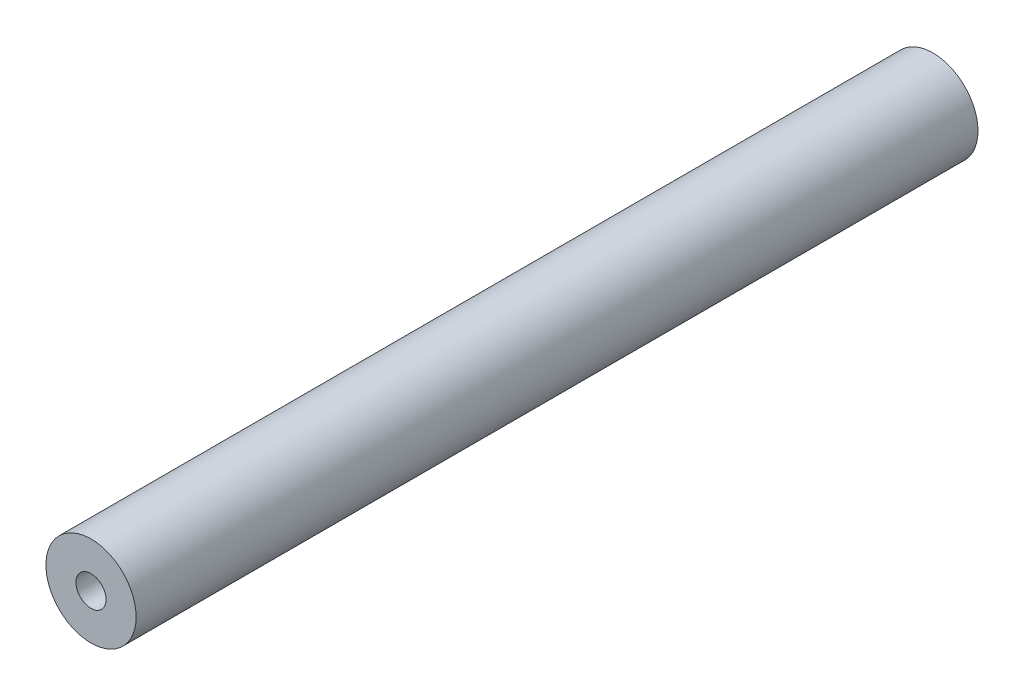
ISO-10303-21;
HEADER;
FILE_DESCRIPTION(('STEP AP214'),'2;1');
FILE_NAME('part.step','',(''),(''),'','','');
FILE_SCHEMA(('AUTOMOTIVE_DESIGN { 1 0 10303 214 1 1 1 1 }'));
ENDSEC;
DATA;
#1=APPLICATION_CONTEXT('core data for automotive mechanical design processes');
#2=APPLICATION_PROTOCOL_DEFINITION('international standard','automotive_design',2000,#1);
#3=PRODUCT_CONTEXT('',#1,'mechanical');
#4=PRODUCT('Part','Part','',(#3));
#5=PRODUCT_RELATED_PRODUCT_CATEGORY('part','',(#4));
#6=PRODUCT_DEFINITION_FORMATION('','',#4);
#7=PRODUCT_DEFINITION_CONTEXT('part definition',#1,'design');
#8=PRODUCT_DEFINITION('design','',#6,#7);
#9=PRODUCT_DEFINITION_SHAPE('','',#8);
#10=(LENGTH_UNIT() NAMED_UNIT(*) SI_UNIT(.MILLI.,.METRE.));
#11=(NAMED_UNIT(*) PLANE_ANGLE_UNIT() SI_UNIT($,.RADIAN.));
#12=(NAMED_UNIT(*) SI_UNIT($,.STERADIAN.) SOLID_ANGLE_UNIT());
#13=UNCERTAINTY_MEASURE_WITH_UNIT(LENGTH_MEASURE(1.E-05),#10,'distance_accuracy_value','');
#14=(GEOMETRIC_REPRESENTATION_CONTEXT(3) GLOBAL_UNCERTAINTY_ASSIGNED_CONTEXT((#13)) GLOBAL_UNIT_ASSIGNED_CONTEXT((#10,
#11,#12)) REPRESENTATION_CONTEXT('',''));
#15=CARTESIAN_POINT('',(0.,0.,0.));
#16=DIRECTION('',(0.,0.,1.));
#17=DIRECTION('',(1.,0.,0.));
#18=AXIS2_PLACEMENT_3D('',#15,#16,#17);
#19=CARTESIAN_POINT('',(0.,0.,140.));
#20=DIRECTION('',(0.,0.,-1.));
#21=DIRECTION('',(-1.,0.,0.));
#22=AXIS2_PLACEMENT_3D('',#19,#20,#21);
#23=CYLINDRICAL_SURFACE('',#22,7.5);
#24=CARTESIAN_POINT('',(0.,0.,140.));
#25=DIRECTION('',(0.,0.,1.));
#26=DIRECTION('',(1.,0.,0.));
#27=AXIS2_PLACEMENT_3D('',#24,#25,#26);
#28=CIRCLE('',#27,7.5);
#29=CARTESIAN_POINT('',(7.5,0.,140.));
#30=VERTEX_POINT('',#29);
#31=EDGE_CURVE('E10',#30,#30,#28,.T.);
#32=ORIENTED_EDGE('',*,*,#31,.F.);
#33=EDGE_LOOP('',(#32));
#34=FACE_BOUND('',#33,.T.);
#35=CARTESIAN_POINT('',(0.,0.,0.));
#36=DIRECTION('',(0.,0.,1.));
#37=DIRECTION('',(1.,0.,0.));
#38=AXIS2_PLACEMENT_3D('',#35,#36,#37);
#39=CIRCLE('',#38,7.5);
#40=CARTESIAN_POINT('',(7.5,0.,0.));
#41=VERTEX_POINT('',#40);
#42=EDGE_CURVE('E33',#41,#41,#39,.T.);
#43=ORIENTED_EDGE('',*,*,#42,.T.);
#44=EDGE_LOOP('',(#43));
#45=FACE_BOUND('',#44,.T.);
#46=ADVANCED_FACE('F30',(#34,#45),#23,.T.);
#47=CARTESIAN_POINT('',(0.,0.,140.));
#48=DIRECTION('',(0.,0.,1.));
#49=DIRECTION('',(1.,0.,0.));
#50=AXIS2_PLACEMENT_3D('',#47,#48,#49);
#51=PLANE('',#50);
#52=CARTESIAN_POINT('',(0.,0.,140.));
#53=DIRECTION('',(0.,0.,1.));
#54=DIRECTION('',(1.,0.,0.));
#55=AXIS2_PLACEMENT_3D('',#52,#53,#54);
#56=CIRCLE('',#55,2.5);
#57=CARTESIAN_POINT('',(2.5,0.,140.));
#58=VERTEX_POINT('',#57);
#59=EDGE_CURVE('E42',#58,#58,#56,.T.);
#60=ORIENTED_EDGE('',*,*,#59,.F.);
#61=EDGE_LOOP('',(#60));
#62=FACE_BOUND('',#61,.T.);
#63=ORIENTED_EDGE('',*,*,#31,.T.);
#64=EDGE_LOOP('',(#63));
#65=FACE_BOUND('',#64,.T.);
#66=ADVANCED_FACE('F67',(#62,#65),#51,.T.);
#67=CARTESIAN_POINT('',(0.,0.,0.));
#68=DIRECTION('',(0.,0.,1.));
#69=DIRECTION('',(1.,0.,0.));
#70=AXIS2_PLACEMENT_3D('',#67,#68,#69);
#71=PLANE('',#70);
#72=CARTESIAN_POINT('',(0.,0.,0.));
#73=DIRECTION('',(0.,0.,-1.));
#74=DIRECTION('',(-1.,0.,0.));
#75=AXIS2_PLACEMENT_3D('',#72,#73,#74);
#76=CIRCLE('',#75,2.5);
#77=CARTESIAN_POINT('',(-2.5,0.,0.));
#78=VERTEX_POINT('',#77);
#79=EDGE_CURVE('E48',#78,#78,#76,.T.);
#80=ORIENTED_EDGE('',*,*,#79,.F.);
#81=EDGE_LOOP('',(#80));
#82=FACE_BOUND('',#81,.T.);
#83=ORIENTED_EDGE('',*,*,#42,.F.);
#84=EDGE_LOOP('',(#83));
#85=FACE_BOUND('',#84,.T.);
#86=ADVANCED_FACE('F63',(#82,#85),#71,.F.);
#87=CARTESIAN_POINT('',(0.,0.,125.));
#88=DIRECTION('',(0.,0.,1.));
#89=DIRECTION('',(1.,0.,0.));
#90=AXIS2_PLACEMENT_3D('',#87,#88,#89);
#91=CYLINDRICAL_SURFACE('',#90,2.5);
#92=CARTESIAN_POINT('',(0.,0.,125.));
#93=DIRECTION('',(0.,0.,1.));
#94=DIRECTION('',(1.,0.,0.));
#95=AXIS2_PLACEMENT_3D('',#92,#93,#94);
#96=CIRCLE('',#95,2.5);
#97=CARTESIAN_POINT('',(2.5,0.,125.));
#98=VERTEX_POINT('',#97);
#99=EDGE_CURVE('E40',#98,#98,#96,.T.);
#100=ORIENTED_EDGE('',*,*,#99,.F.);
#101=EDGE_LOOP('',(#100));
#102=FACE_BOUND('',#101,.T.);
#103=ORIENTED_EDGE('',*,*,#59,.T.);
#104=EDGE_LOOP('',(#103));
#105=FACE_BOUND('',#104,.T.);
#106=ADVANCED_FACE('F66',(#102,#105),#91,.F.);
#107=CARTESIAN_POINT('',(0.,0.,125.));
#108=DIRECTION('',(0.,0.,1.));
#109=DIRECTION('',(1.,0.,0.));
#110=AXIS2_PLACEMENT_3D('',#107,#108,#109);
#111=PLANE('',#110);
#112=ORIENTED_EDGE('',*,*,#99,.T.);
#113=EDGE_LOOP('',(#112));
#114=FACE_BOUND('',#113,.T.);
#115=ADVANCED_FACE('F59',(#114),#111,.T.);
#116=CARTESIAN_POINT('',(0.,0.,15.));
#117=DIRECTION('',(0.,0.,-1.));
#118=DIRECTION('',(-1.,0.,0.));
#119=AXIS2_PLACEMENT_3D('',#116,#117,#118);
#120=CYLINDRICAL_SURFACE('',#119,2.5);
#121=CARTESIAN_POINT('',(0.,0.,15.));
#122=DIRECTION('',(0.,0.,-1.));
#123=DIRECTION('',(-1.,0.,0.));
#124=AXIS2_PLACEMENT_3D('',#121,#122,#123);
#125=CIRCLE('',#124,2.5);
#126=CARTESIAN_POINT('',(-2.5,0.,15.));
#127=VERTEX_POINT('',#126);
#128=EDGE_CURVE('E45',#127,#127,#125,.T.);
#129=ORIENTED_EDGE('',*,*,#128,.F.);
#130=EDGE_LOOP('',(#129));
#131=FACE_BOUND('',#130,.T.);
#132=ORIENTED_EDGE('',*,*,#79,.T.);
#133=EDGE_LOOP('',(#132));
#134=FACE_BOUND('',#133,.T.);
#135=ADVANCED_FACE('F56',(#131,#134),#120,.F.);
#136=CARTESIAN_POINT('',(0.,0.,15.));
#137=DIRECTION('',(0.,0.,-1.));
#138=DIRECTION('',(-1.,0.,0.));
#139=AXIS2_PLACEMENT_3D('',#136,#137,#138);
#140=PLANE('',#139);
#141=ORIENTED_EDGE('',*,*,#128,.T.);
#142=EDGE_LOOP('',(#141));
#143=FACE_BOUND('',#142,.T.);
#144=ADVANCED_FACE('F54',(#143),#140,.T.);
#145=CLOSED_SHELL('',(#46,#66,#86,#106,#115,#135,#144));
#146=MANIFOLD_SOLID_BREP('B2',#145);
#147=ADVANCED_BREP_SHAPE_REPRESENTATION('',(#18,#146),#14);
#148=SHAPE_DEFINITION_REPRESENTATION(#9,#147);
ENDSEC;
END-ISO-10303-21;
